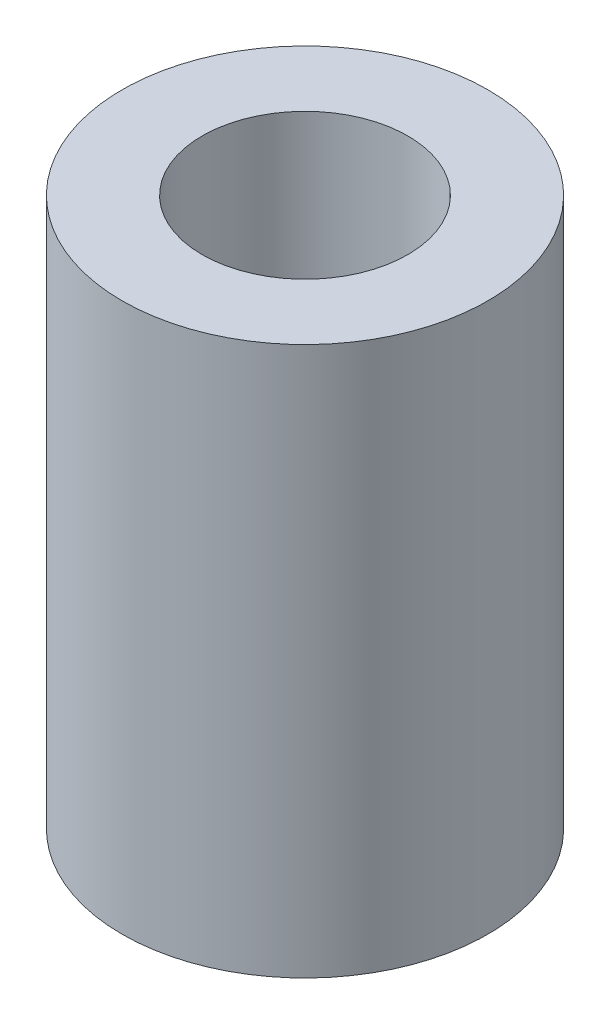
from build123d import *

# Parameters (mm, degrees)
SKETCH1_R      = 4
SKETCH1_R_2    = 2.25
EXTRUDE1_DEPTH = 12


with BuildPart() as part:
    # Sketch1 → Extrude1 (new body)
    with BuildSketch(Plane(origin=(0, 0, 0), x_dir=(1, 0, 0), z_dir=(0, 1, 0))):
        with Locations(Location((0, 0, 0), (0, 0, 270))):
            Circle(SKETCH1_R)
        with Locations(Location((0, 0, 0), (0, 0, 270))):
            Circle(SKETCH1_R_2, mode=Mode.SUBTRACT)
    extrude(amount=EXTRUDE1_DEPTH)


solid = part.part
